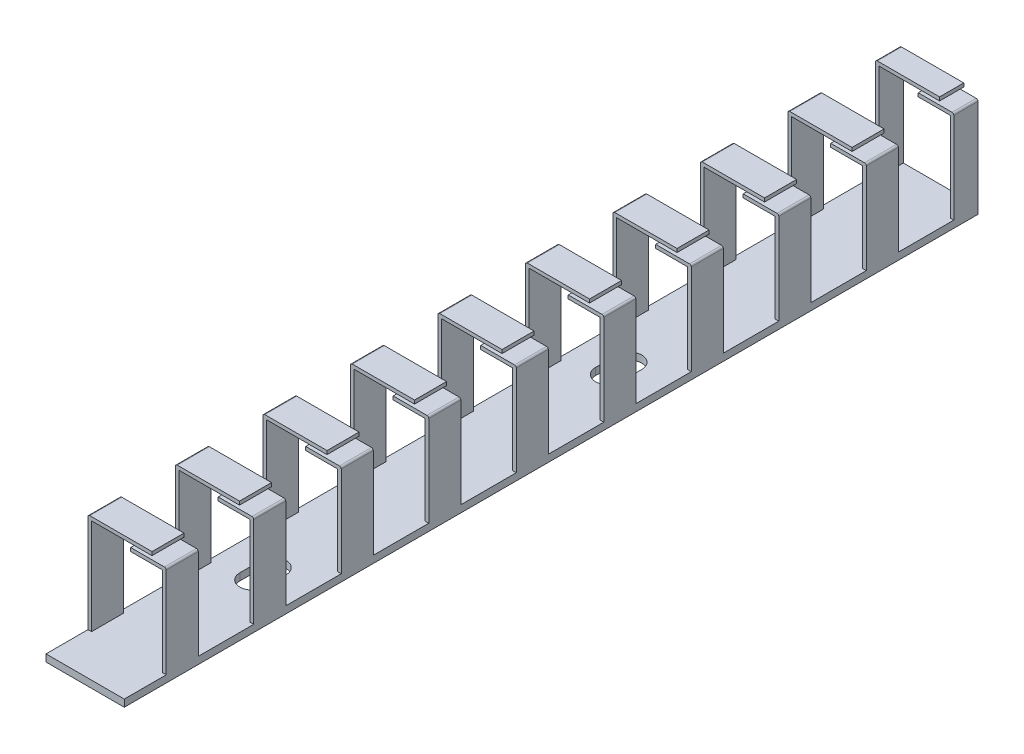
from build123d import *

# Parameters (mm, degrees)
BOSS_EXTRU_1_DEPTH      = 250
ESQUISSE2_W             = 7.8
ESQUISSE2_H             = 16
ENL_V_MAT_EXTRU_1_DEPTH = 251.691044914
ENL_V_MAT_EXTRU_2_REACH = 252.691
ESQUISSE5_W             = 11
ESQUISSE5_H             = 130
ENL_V_MAT_EXTRU_3_DEPTH = 251.691044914


with BuildPart() as part:
    # Esquisse1 → Boss.-Extru.1 (new body)
    with BuildSketch(Plane.XY):
        with BuildLine():
            Line((0, 0), (0, 14.75))
            ThreePointArc((0, 14.75), (0.073223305, 14.926776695), (0.25, 15))
            Line((0.25, 15), (9, 15))
            Line((9, 15), (9, 14.5))
            Line((9, 14.5), (0.5, 14.5))
            Line((0.5, 14.5), (0.5, 1))
            Line((0.5, 1), (10.5, 1))
            Line((10.5, 1), (10.5, 13.5))
            Line((10.5, 13.5), (6, 13.5))
            Line((6, 13.5), (6, 14))
            Line((6, 14), (10.75, 14))
            ThreePointArc((10.75, 14), (10.926776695, 13.926776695), (11, 13.75))
            Line((11, 13.75), (11, 0))
            Line((11, 0), (0, 0))
        make_face()
    extrude(amount=BOSS_EXTRU_1_DEPTH)

    # Esquisse2 → Enl_v. mat.-Extru.1 (cut, through all)
    with BuildSketch(Plane(origin=(11, 0, 0), x_dir=(0, 0, -1), z_dir=(1, 0, 0))):
        with Locations((-125, 9)):
            Rectangle(ESQUISSE2_W, ESQUISSE2_H)
        with Locations((-112.7, 9)):
            Rectangle(ESQUISSE2_W, ESQUISSE2_H)
        with Locations((-100.4, 9)):
            Rectangle(ESQUISSE2_W, ESQUISSE2_H)
        with Locations((-88.1, 9)):
            Rectangle(ESQUISSE2_W, ESQUISSE2_H)
        with Locations((-75.8, 9)):
            Rectangle(ESQUISSE2_W, ESQUISSE2_H)
        with Locations((-63.5, 9)):
            Rectangle(ESQUISSE2_W, ESQUISSE2_H)
        with Locations((-51.2, 9)):
            Rectangle(ESQUISSE2_W, ESQUISSE2_H)
        with Locations((-38.9, 9)):
            Rectangle(ESQUISSE2_W, ESQUISSE2_H)
        with Locations((-26.6, 9)):
            Rectangle(ESQUISSE2_W, ESQUISSE2_H)
        with Locations((-14.3, 9)):
            Rectangle(ESQUISSE2_W, ESQUISSE2_H)
        with Locations((-2, 9)):
            Rectangle(ESQUISSE2_W, ESQUISSE2_H)
        with Locations((-137.3, 9)):
            Rectangle(ESQUISSE2_W, ESQUISSE2_H)
        with Locations((-149.6, 9)):
            Rectangle(ESQUISSE2_W, ESQUISSE2_H)
        with Locations((-161.9, 9)):
            Rectangle(ESQUISSE2_W, ESQUISSE2_H)
        with Locations((-174.2, 9)):
            Rectangle(ESQUISSE2_W, ESQUISSE2_H)
        with Locations((-186.5, 9)):
            Rectangle(ESQUISSE2_W, ESQUISSE2_H)
        with Locations((-198.8, 9)):
            Rectangle(ESQUISSE2_W, ESQUISSE2_H)
        with Locations((-211.1, 9)):
            Rectangle(ESQUISSE2_W, ESQUISSE2_H)
        with Locations((-223.4, 9)):
            Rectangle(ESQUISSE2_W, ESQUISSE2_H)
        with Locations((-235.7, 9)):
            Rectangle(ESQUISSE2_W, ESQUISSE2_H)
        with Locations((-248, 9)):
            Rectangle(ESQUISSE2_W, ESQUISSE2_H)
    extrude(amount=-ENL_V_MAT_EXTRU_1_DEPTH, mode=Mode.SUBTRACT)

    # Esquisse4 → Enl_v. mat.-Extru.2 (cut, up to next)
    with BuildSketch(Plane.XZ, mode=Mode.PRIVATE) as enl_v_mat_extru_2_sk1:
        with BuildLine():
            Line((7.25, 226.5), (7.25, 223.5))
            ThreePointArc((7.25, 223.5), (5.5, 221.75), (3.75, 223.5))
            Line((3.75, 223.5), (3.75, 226.5))
            ThreePointArc((3.75, 226.5), (5.5, 228.25), (7.25, 226.5))
        make_face()
    enl_v_mat_extru_2_tool1 = extrude(enl_v_mat_extru_2_sk1.sketch, amount=-ENL_V_MAT_EXTRU_2_REACH, mode=Mode.PRIVATE) & part.part
    # Esquisse4 → Enl_v. mat.-Extru.2 (cut, up to next)
    with BuildSketch(Plane.XZ, mode=Mode.PRIVATE) as enl_v_mat_extru_2_sk2:
        with BuildLine():
            Line((7.25, 176.5), (7.25, 173.5))
            ThreePointArc((7.25, 173.5), (5.5, 171.75), (3.75, 173.5))
            Line((3.75, 173.5), (3.75, 176.5))
            ThreePointArc((3.75, 176.5), (5.5, 178.25), (7.25, 176.5))
        make_face()
    enl_v_mat_extru_2_tool2 = extrude(enl_v_mat_extru_2_sk2.sketch, amount=-ENL_V_MAT_EXTRU_2_REACH, mode=Mode.PRIVATE) & part.part
    # Esquisse4 → Enl_v. mat.-Extru.2 (cut, up to next)
    with BuildSketch(Plane.XZ, mode=Mode.PRIVATE) as enl_v_mat_extru_2_sk3:
        with BuildLine():
            Line((7.25, 126.5), (7.25, 123.5))
            ThreePointArc((7.25, 123.5), (5.5, 121.75), (3.75, 123.5))
            Line((3.75, 123.5), (3.75, 126.5))
            ThreePointArc((3.75, 126.5), (5.5, 128.25), (7.25, 126.5))
        make_face()
    enl_v_mat_extru_2_tool3 = extrude(enl_v_mat_extru_2_sk3.sketch, amount=-ENL_V_MAT_EXTRU_2_REACH, mode=Mode.PRIVATE) & part.part
    # Esquisse4 → Enl_v. mat.-Extru.2 (cut, up to next)
    with BuildSketch(Plane.XZ, mode=Mode.PRIVATE) as enl_v_mat_extru_2_sk4:
        with BuildLine():
            Line((7.25, 76.5), (7.25, 73.5))
            ThreePointArc((7.25, 73.5), (5.5, 71.75), (3.75, 73.5))
            Line((3.75, 73.5), (3.75, 76.5))
            ThreePointArc((3.75, 76.5), (5.5, 78.25), (7.25, 76.5))
        make_face()
    enl_v_mat_extru_2_tool4 = extrude(enl_v_mat_extru_2_sk4.sketch, amount=-ENL_V_MAT_EXTRU_2_REACH, mode=Mode.PRIVATE) & part.part
    # Esquisse4 → Enl_v. mat.-Extru.2 (cut, up to next)
    with BuildSketch(Plane.XZ, mode=Mode.PRIVATE) as enl_v_mat_extru_2_sk5:
        with BuildLine():
            Line((7.25, 26.5), (7.25, 23.5))
            ThreePointArc((7.25, 23.5), (5.5, 21.75), (3.75, 23.5))
            Line((3.75, 23.5), (3.75, 26.5))
            ThreePointArc((3.75, 26.5), (5.5, 28.25), (7.25, 26.5))
        make_face()
    enl_v_mat_extru_2_tool5 = extrude(enl_v_mat_extru_2_sk5.sketch, amount=-ENL_V_MAT_EXTRU_2_REACH, mode=Mode.PRIVATE) & part.part
    add(enl_v_mat_extru_2_tool1.solids().sort_by_distance((5.5, 0, 225))[0], mode=Mode.SUBTRACT)
    add(enl_v_mat_extru_2_tool2.solids().sort_by_distance((5.5, 0, 175))[0], mode=Mode.SUBTRACT)
    add(enl_v_mat_extru_2_tool3.solids().sort_by_distance((5.5, 0, 125))[0], mode=Mode.SUBTRACT)
    add(enl_v_mat_extru_2_tool4.solids().sort_by_distance((5.5, 0, 75))[0], mode=Mode.SUBTRACT)
    add(enl_v_mat_extru_2_tool5.solids().sort_by_distance((5.5, 0, 25))[0], mode=Mode.SUBTRACT)

    # Esquisse5 → Enl_v. mat.-Extru.3 (cut, through all)
    with BuildSketch(Plane(origin=(0, 0, 0), x_dir=(-1, 0, 0), z_dir=(0, -1, 0))):
        with Locations((-5.5, -65)):
            Rectangle(ESQUISSE5_W, ESQUISSE5_H)
    extrude(amount=-ENL_V_MAT_EXTRU_3_DEPTH, mode=Mode.SUBTRACT)


solid = part.part
